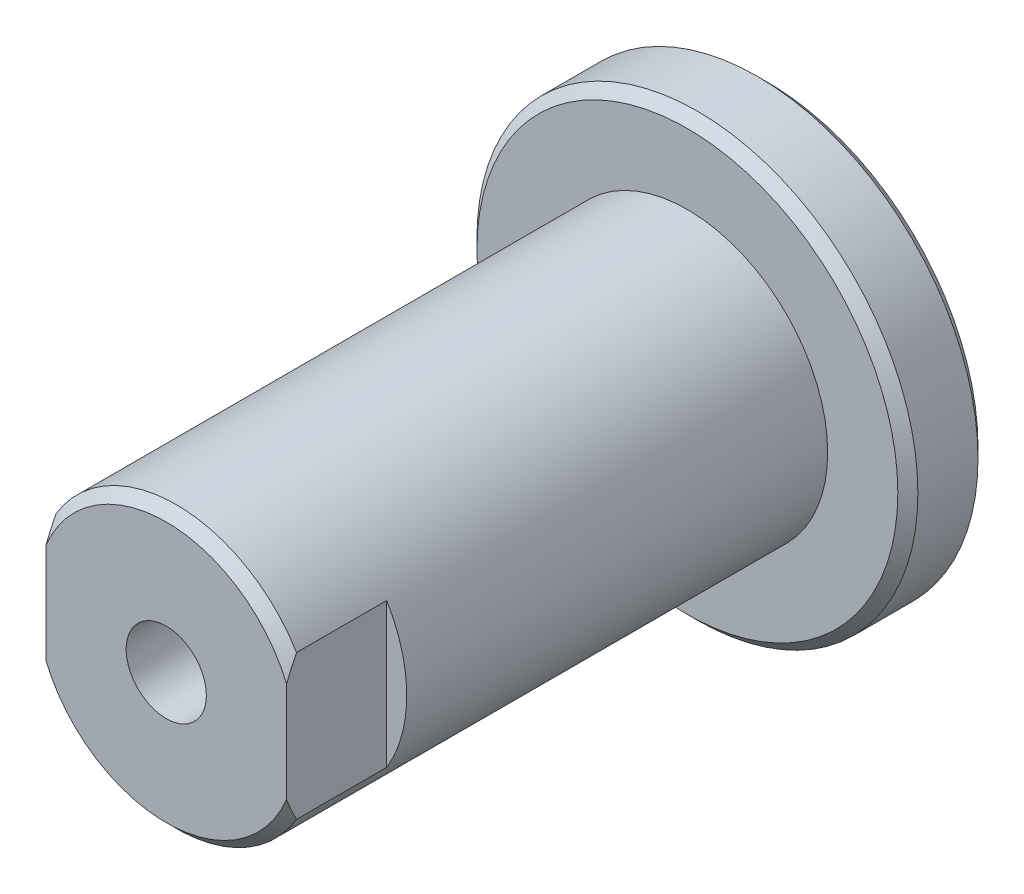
ISO-10303-21;
HEADER;
FILE_DESCRIPTION(('STEP AP214'),'2;1');
FILE_NAME('part.step','',(''),(''),'','','');
FILE_SCHEMA(('AUTOMOTIVE_DESIGN { 1 0 10303 214 1 1 1 1 }'));
ENDSEC;
DATA;
#1=APPLICATION_CONTEXT('core data for automotive mechanical design processes');
#2=APPLICATION_PROTOCOL_DEFINITION('international standard','automotive_design',2000,#1);
#3=PRODUCT_CONTEXT('',#1,'mechanical');
#4=PRODUCT('Part','Part','',(#3));
#5=PRODUCT_RELATED_PRODUCT_CATEGORY('part','',(#4));
#6=PRODUCT_DEFINITION_FORMATION('','',#4);
#7=PRODUCT_DEFINITION_CONTEXT('part definition',#1,'design');
#8=PRODUCT_DEFINITION('design','',#6,#7);
#9=PRODUCT_DEFINITION_SHAPE('','',#8);
#10=(LENGTH_UNIT() NAMED_UNIT(*) SI_UNIT(.MILLI.,.METRE.));
#11=(NAMED_UNIT(*) PLANE_ANGLE_UNIT() SI_UNIT($,.RADIAN.));
#12=(NAMED_UNIT(*) SI_UNIT($,.STERADIAN.) SOLID_ANGLE_UNIT());
#13=UNCERTAINTY_MEASURE_WITH_UNIT(LENGTH_MEASURE(1.E-05),#10,'distance_accuracy_value','');
#14=(GEOMETRIC_REPRESENTATION_CONTEXT(3) GLOBAL_UNCERTAINTY_ASSIGNED_CONTEXT((#13)) GLOBAL_UNIT_ASSIGNED_CONTEXT((#10,
#11,#12)) REPRESENTATION_CONTEXT('',''));
#15=CARTESIAN_POINT('',(0.,0.,0.));
#16=DIRECTION('',(0.,0.,1.));
#17=DIRECTION('',(1.,0.,0.));
#18=AXIS2_PLACEMENT_3D('',#15,#16,#17);
#19=CARTESIAN_POINT('',(0.,0.,30.));
#20=DIRECTION('',(0.,0.,-1.));
#21=DIRECTION('',(-1.,0.,0.));
#22=AXIS2_PLACEMENT_3D('',#19,#20,#21);
#23=CONICAL_SURFACE('',#22,6.5,0.785398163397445);
#24=CARTESIAN_POINT('',(-6.,-14.189120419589,21.0944445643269));
#25=CARTESIAN_POINT('',(-6.,-13.9783762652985,21.2885446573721));
#26=CARTESIAN_POINT('',(-6.,-13.7673091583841,21.4822940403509));
#27=CARTESIAN_POINT('',(-6.,-13.3444339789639,21.8689856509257));
#28=CARTESIAN_POINT('',(-6.,-13.1326259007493,22.0619278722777));
#29=CARTESIAN_POINT('',(-6.,-12.4958585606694,22.6394659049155));
#30=CARTESIAN_POINT('',(-6.,-12.0696493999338,23.0226870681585));
#31=CARTESIAN_POINT('',(-6.,-11.2102831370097,23.7865653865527));
#32=CARTESIAN_POINT('',(-6.,-10.7770995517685,24.1671928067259));
#33=CARTESIAN_POINT('',(-6.,-9.90489563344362,24.9216189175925));
#34=CARTESIAN_POINT('',(-6.,-9.46587600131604,25.2954184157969));
#35=CARTESIAN_POINT('',(-6.,-8.66228186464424,25.9645716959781));
#36=CARTESIAN_POINT('',(-6.,-8.29907851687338,26.2615642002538));
#37=CARTESIAN_POINT('',(-6.,-7.74886070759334,26.700373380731));
#38=CARTESIAN_POINT('',(-6.,-7.56452615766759,26.845549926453));
#39=CARTESIAN_POINT('',(-6.,-7.19377345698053,27.133214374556));
#40=CARTESIAN_POINT('',(-6.,-7.00735535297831,27.2757023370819));
#41=CARTESIAN_POINT('',(-6.,-6.63228473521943,27.5573006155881));
#42=CARTESIAN_POINT('',(-6.,-6.44363475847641,27.6964143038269));
#43=CARTESIAN_POINT('',(-6.,-6.0635049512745,27.9707110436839));
#44=CARTESIAN_POINT('',(-6.,-5.87202526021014,28.1058942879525));
#45=CARTESIAN_POINT('',(-6.,-5.48581052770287,28.3713809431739));
#46=CARTESIAN_POINT('',(-6.,-5.29107678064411,28.5016862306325));
#47=CARTESIAN_POINT('',(-6.,-4.89772697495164,28.756276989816));
#48=CARTESIAN_POINT('',(-6.,-4.69911136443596,28.8805631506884));
#49=CARTESIAN_POINT('',(-6.,-4.29915222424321,29.1204786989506));
#50=CARTESIAN_POINT('',(-6.,-4.09785008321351,29.2361766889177));
#51=CARTESIAN_POINT('',(-6.,-3.69005957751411,29.4581762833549));
#52=CARTESIAN_POINT('',(-6.,-3.48357065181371,29.5644768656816));
#53=CARTESIAN_POINT('',(-6.,-3.06498745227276,29.7649849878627));
#54=CARTESIAN_POINT('',(-6.,-2.8528986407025,29.859203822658));
#55=CARTESIAN_POINT('',(-6.,-2.42254844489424,30.0323888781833));
#56=CARTESIAN_POINT('',(-6.,-2.20428887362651,30.1113595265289));
#57=CARTESIAN_POINT('',(-6.,-1.80920727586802,30.2353361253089));
#58=CARTESIAN_POINT('',(-6.,-1.63353777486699,30.2839940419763));
#59=CARTESIAN_POINT('',(-6.,-1.27894637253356,30.3676229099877));
#60=CARTESIAN_POINT('',(-6.,-1.10002490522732,30.4025956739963));
#61=CARTESIAN_POINT('',(-6.,-0.740353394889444,30.4570998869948));
#62=CARTESIAN_POINT('',(-6.,-0.559610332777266,30.4766767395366));
#63=CARTESIAN_POINT('',(-6.,-0.197085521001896,30.4994890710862));
#64=CARTESIAN_POINT('',(-6.,-0.0153038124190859,30.5027251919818));
#65=CARTESIAN_POINT('',(-6.,0.348026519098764,30.4926630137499));
#66=CARTESIAN_POINT('',(-6.,0.529574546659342,30.4793435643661));
#67=CARTESIAN_POINT('',(-6.,0.890796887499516,30.4368881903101));
#68=CARTESIAN_POINT('',(-6.,1.07047104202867,30.4077509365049));
#69=CARTESIAN_POINT('',(-6.,1.42740071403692,30.3350322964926));
#70=CARTESIAN_POINT('',(-6.,1.60464720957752,30.2914072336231));
#71=CARTESIAN_POINT('',(-6.,1.9555280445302,30.1916103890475));
#72=CARTESIAN_POINT('',(-6.,2.12916232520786,30.1354384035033));
#73=CARTESIAN_POINT('',(-6.,2.50243151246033,30.0017905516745));
#74=CARTESIAN_POINT('',(-6.,2.70134325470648,29.9223089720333));
#75=CARTESIAN_POINT('',(-6.,3.09406710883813,29.7515219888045));
#76=CARTESIAN_POINT('',(-6.,3.28787684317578,29.6602111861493));
#77=CARTESIAN_POINT('',(-6.,3.67106823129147,29.467985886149));
#78=CARTESIAN_POINT('',(-6.,3.86044140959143,29.3670546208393));
#79=CARTESIAN_POINT('',(-6.,4.23490054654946,29.157636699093));
#80=CARTESIAN_POINT('',(-6.,4.41998710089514,29.0491511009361));
#81=CARTESIAN_POINT('',(-6.,4.78863644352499,28.8247540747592));
#82=CARTESIAN_POINT('',(-6.,4.97215428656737,28.7087691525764));
#83=CARTESIAN_POINT('',(-6.,5.33589527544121,28.4717527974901));
#84=CARTESIAN_POINT('',(-6.,5.51611833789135,28.3507212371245));
#85=CARTESIAN_POINT('',(-6.,5.87353199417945,28.1046683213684));
#86=CARTESIAN_POINT('',(-6.,6.05072558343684,27.9796513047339));
#87=CARTESIAN_POINT('',(-6.,6.4026678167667,27.7262165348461));
#88=CARTESIAN_POINT('',(-6.,6.57741636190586,27.5977986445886));
#89=CARTESIAN_POINT('',(-6.,7.0861535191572,27.2175520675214));
#90=CARTESIAN_POINT('',(-6.,7.41727857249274,26.9618924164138));
#91=CARTESIAN_POINT('',(-6.,8.0735777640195,26.4430411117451));
#92=CARTESIAN_POINT('',(-6.,8.39875139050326,26.1798488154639));
#93=CARTESIAN_POINT('',(-6.,9.04470289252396,25.6476667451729));
#94=CARTESIAN_POINT('',(-6.,9.3654774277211,25.3786729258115));
#95=CARTESIAN_POINT('',(-6.,10.0033851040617,24.836401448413));
#96=CARTESIAN_POINT('',(-6.,10.3205181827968,24.5631237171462));
#97=CARTESIAN_POINT('',(-6.,10.9366376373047,24.0264970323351));
#98=CARTESIAN_POINT('',(-6.,11.2357612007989,23.7633053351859));
#99=CARTESIAN_POINT('',(-6.,11.8318528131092,23.2344867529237));
#100=CARTESIAN_POINT('',(-6.,12.1288208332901,22.9688598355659));
#101=CARTESIAN_POINT('',(-6.,12.7205312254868,22.4360265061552));
#102=CARTESIAN_POINT('',(-6.,13.0152762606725,22.1688230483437));
#103=CARTESIAN_POINT('',(-6.,13.6032575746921,21.6327807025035));
#104=CARTESIAN_POINT('',(-6.,13.8964939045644,21.3639418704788));
#105=CARTESIAN_POINT('',(-6.,14.189120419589,21.0944445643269));
#106=B_SPLINE_CURVE_WITH_KNOTS('',3,(#24,#25,#26,#27,#28,#29,#30,#31,#32,#33,#34,#35,#36,#37,
#38,#39,#40,#41,#42,#43,#44,#45,#46,#47,#48,#49,#50,#51,#52,#53,#54,#55,#56,#57,#58,#59,#60,#61,
#62,#63,#64,#65,#66,#67,#68,#69,#70,#71,#72,#73,#74,#75,#76,#77,#78,#79,#80,#81,#82,#83,#84,#85,
#86,#87,#88,#89,#90,#91,#92,#93,#94,#95,#96,#97,#98,#99,#100,#101,#102,#103,#104,#105),
.UNSPECIFIED.,.F.,.F.,(4,2,2,2,2,2,2,2,2,2,2,2,2,2,2,2,2,2,2,2,2,2,2,2,2,2,2,2,2,2,2,2,2,2,2,2,
2,2,2,2,4),(0.,0.8595290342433,1.71906470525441,3.43851653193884,5.16841774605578,
6.89811302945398,8.30550929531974,9.00940677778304,9.71328849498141,10.4164350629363,
11.1195471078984,11.8223858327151,12.5251438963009,13.2214938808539,13.9179195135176,
14.6136892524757,15.3092566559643,15.8556421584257,16.4019552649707,16.9466511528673,
17.4913256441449,18.0366966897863,18.5821135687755,19.129189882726,19.6762750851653,
20.3183990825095,20.960817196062,21.6043762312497,22.2478452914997,22.8990367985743,
23.5502447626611,24.2007664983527,24.8513144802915,26.106152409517,27.3610977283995,
28.6169483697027,29.872820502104,31.0680882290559,32.2633718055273,33.4568688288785,
34.6503252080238),.UNSPECIFIED.);
#107=CARTESIAN_POINT('',(-6.,-3.60555127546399,29.5));
#108=VERTEX_POINT('',#107);
#109=CARTESIAN_POINT('',(-6.,-2.5,30.));
#110=VERTEX_POINT('',#109);
#111=EDGE_CURVE('E39',#108,#110,#106,.T.);
#112=ORIENTED_EDGE('',*,*,#111,.F.);
#113=CARTESIAN_POINT('',(0.,0.,29.5));
#114=DIRECTION('',(0.,0.,1.));
#115=DIRECTION('',(1.,0.,0.));
#116=AXIS2_PLACEMENT_3D('',#113,#114,#115);
#117=CIRCLE('',#116,7.);
#118=CARTESIAN_POINT('',(6.,-3.60555127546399,29.5));
#119=VERTEX_POINT('',#118);
#120=EDGE_CURVE('E108',#119,#108,#117,.F.);
#121=ORIENTED_EDGE('',*,*,#120,.F.);
#122=CARTESIAN_POINT('',(6.,14.189120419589,21.0944445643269));
#123=CARTESIAN_POINT('',(6.,13.9783762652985,21.2885446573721));
#124=CARTESIAN_POINT('',(6.,13.7673091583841,21.4822940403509));
#125=CARTESIAN_POINT('',(6.,13.3444339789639,21.8689856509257));
#126=CARTESIAN_POINT('',(6.,13.1326259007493,22.0619278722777));
#127=CARTESIAN_POINT('',(6.,12.4958585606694,22.6394659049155));
#128=CARTESIAN_POINT('',(6.,12.0696493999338,23.0226870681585));
#129=CARTESIAN_POINT('',(6.,11.2102831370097,23.7865653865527));
#130=CARTESIAN_POINT('',(6.,10.7770995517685,24.1671928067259));
#131=CARTESIAN_POINT('',(6.,9.90489563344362,24.9216189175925));
#132=CARTESIAN_POINT('',(6.,9.46587600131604,25.2954184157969));
#133=CARTESIAN_POINT('',(6.,8.66228186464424,25.9645716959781));
#134=CARTESIAN_POINT('',(6.,8.29907851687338,26.2615642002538));
#135=CARTESIAN_POINT('',(6.,7.74886070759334,26.700373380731));
#136=CARTESIAN_POINT('',(6.,7.56452615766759,26.845549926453));
#137=CARTESIAN_POINT('',(6.,7.19377345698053,27.133214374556));
#138=CARTESIAN_POINT('',(6.,7.00735535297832,27.2757023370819));
#139=CARTESIAN_POINT('',(6.,6.63228473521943,27.5573006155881));
#140=CARTESIAN_POINT('',(6.,6.44363475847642,27.6964143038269));
#141=CARTESIAN_POINT('',(6.,6.06350495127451,27.9707110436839));
#142=CARTESIAN_POINT('',(6.,5.87202526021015,28.1058942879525));
#143=CARTESIAN_POINT('',(6.,5.48581052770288,28.3713809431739));
#144=CARTESIAN_POINT('',(6.,5.29107678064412,28.5016862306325));
#145=CARTESIAN_POINT('',(6.,4.89772697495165,28.756276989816));
#146=CARTESIAN_POINT('',(6.,4.69911136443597,28.8805631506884));
#147=CARTESIAN_POINT('',(6.,4.29915222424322,29.1204786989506));
#148=CARTESIAN_POINT('',(6.,4.09785008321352,29.2361766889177));
#149=CARTESIAN_POINT('',(6.,3.69005957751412,29.4581762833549));
#150=CARTESIAN_POINT('',(6.,3.48357065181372,29.5644768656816));
#151=CARTESIAN_POINT('',(6.,3.06498745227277,29.7649849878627));
#152=CARTESIAN_POINT('',(6.,2.85289864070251,29.859203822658));
#153=CARTESIAN_POINT('',(6.,2.42254844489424,30.0323888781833));
#154=CARTESIAN_POINT('',(6.,2.20428887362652,30.1113595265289));
#155=CARTESIAN_POINT('',(6.,1.80920727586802,30.2353361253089));
#156=CARTESIAN_POINT('',(6.,1.633537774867,30.2839940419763));
#157=CARTESIAN_POINT('',(6.,1.27894637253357,30.3676229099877));
#158=CARTESIAN_POINT('',(6.,1.10002490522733,30.4025956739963));
#159=CARTESIAN_POINT('',(6.,0.740353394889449,30.4570998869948));
#160=CARTESIAN_POINT('',(6.,0.559610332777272,30.4766767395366));
#161=CARTESIAN_POINT('',(6.,0.197085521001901,30.4994890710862));
#162=CARTESIAN_POINT('',(6.,0.0153038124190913,30.5027251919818));
#163=CARTESIAN_POINT('',(6.,-0.348026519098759,30.4926630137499));
#164=CARTESIAN_POINT('',(6.,-0.529574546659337,30.4793435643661));
#165=CARTESIAN_POINT('',(6.,-0.890796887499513,30.4368881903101));
#166=CARTESIAN_POINT('',(6.,-1.07047104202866,30.4077509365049));
#167=CARTESIAN_POINT('',(6.,-1.42740071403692,30.3350322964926));
#168=CARTESIAN_POINT('',(6.,-1.60464720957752,30.2914072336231));
#169=CARTESIAN_POINT('',(6.,-1.95552804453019,30.1916103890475));
#170=CARTESIAN_POINT('',(6.,-2.12916232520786,30.1354384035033));
#171=CARTESIAN_POINT('',(6.,-2.50243151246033,30.0017905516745));
#172=CARTESIAN_POINT('',(6.,-2.70134325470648,29.9223089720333));
#173=CARTESIAN_POINT('',(6.,-3.09406710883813,29.7515219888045));
#174=CARTESIAN_POINT('',(6.,-3.28787684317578,29.6602111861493));
#175=CARTESIAN_POINT('',(6.,-3.67106823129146,29.467985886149));
#176=CARTESIAN_POINT('',(6.,-3.86044140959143,29.3670546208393));
#177=CARTESIAN_POINT('',(6.,-4.23490054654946,29.157636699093));
#178=CARTESIAN_POINT('',(6.,-4.41998710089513,29.0491511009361));
#179=CARTESIAN_POINT('',(6.,-4.78863644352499,28.8247540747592));
#180=CARTESIAN_POINT('',(6.,-4.97215428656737,28.7087691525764));
#181=CARTESIAN_POINT('',(6.,-5.3358952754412,28.4717527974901));
#182=CARTESIAN_POINT('',(6.,-5.51611833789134,28.3507212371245));
#183=CARTESIAN_POINT('',(6.,-5.87353199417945,28.1046683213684));
#184=CARTESIAN_POINT('',(6.,-6.05072558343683,27.9796513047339));
#185=CARTESIAN_POINT('',(6.,-6.40266781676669,27.7262165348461));
#186=CARTESIAN_POINT('',(6.,-6.57741636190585,27.5977986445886));
#187=CARTESIAN_POINT('',(6.,-7.08615351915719,27.2175520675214));
#188=CARTESIAN_POINT('',(6.,-7.41727857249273,26.9618924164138));
#189=CARTESIAN_POINT('',(6.,-8.07357776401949,26.4430411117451));
#190=CARTESIAN_POINT('',(6.,-8.39875139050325,26.1798488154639));
#191=CARTESIAN_POINT('',(6.,-9.04470289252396,25.6476667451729));
#192=CARTESIAN_POINT('',(6.,-9.36547742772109,25.3786729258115));
#193=CARTESIAN_POINT('',(6.,-10.0033851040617,24.836401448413));
#194=CARTESIAN_POINT('',(6.,-10.3205181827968,24.5631237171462));
#195=CARTESIAN_POINT('',(6.,-10.9366376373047,24.0264970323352));
#196=CARTESIAN_POINT('',(6.,-11.2357612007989,23.7633053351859));
#197=CARTESIAN_POINT('',(6.,-11.8318528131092,23.2344867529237));
#198=CARTESIAN_POINT('',(6.,-12.1288208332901,22.9688598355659));
#199=CARTESIAN_POINT('',(6.,-12.7205312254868,22.4360265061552));
#200=CARTESIAN_POINT('',(6.,-13.0152762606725,22.1688230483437));
#201=CARTESIAN_POINT('',(6.,-13.6032575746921,21.6327807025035));
#202=CARTESIAN_POINT('',(6.,-13.8964939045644,21.3639418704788));
#203=CARTESIAN_POINT('',(6.,-14.189120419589,21.0944445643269));
#204=B_SPLINE_CURVE_WITH_KNOTS('',3,(#122,#123,#124,#125,#126,#127,#128,#129,#130,#131,#132,
#133,#134,#135,#136,#137,#138,#139,#140,#141,#142,#143,#144,#145,#146,#147,#148,#149,#150,#151,
#152,#153,#154,#155,#156,#157,#158,#159,#160,#161,#162,#163,#164,#165,#166,#167,#168,#169,#170,
#171,#172,#173,#174,#175,#176,#177,#178,#179,#180,#181,#182,#183,#184,#185,#186,#187,#188,#189,
#190,#191,#192,#193,#194,#195,#196,#197,#198,#199,#200,#201,#202,#203),.UNSPECIFIED.,.F.,.F.,(4,
2,2,2,2,2,2,2,2,2,2,2,2,2,2,2,2,2,2,2,2,2,2,2,2,2,2,2,2,2,2,2,2,2,2,2,2,2,2,2,4),(0.,
0.859529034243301,1.71906470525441,3.43851653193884,5.16841774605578,6.89811302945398,
8.30550929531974,9.00940677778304,9.7132884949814,10.4164350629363,11.1195471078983,
11.822385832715,12.5251438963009,13.2214938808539,13.9179195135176,14.6136892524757,
15.3092566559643,15.8556421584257,16.4019552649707,16.9466511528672,17.4913256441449,
18.0366966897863,18.5821135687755,19.129189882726,19.6762750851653,20.3183990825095,
20.960817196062,21.6043762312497,22.2478452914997,22.8990367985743,23.5502447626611,
24.2007664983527,24.8513144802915,26.106152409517,27.3610977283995,28.6169483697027,
29.872820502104,31.0680882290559,32.2633718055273,33.4568688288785,34.6503252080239),.UNSPECIFIED.);
#205=CARTESIAN_POINT('',(6.,-2.5,30.));
#206=VERTEX_POINT('',#205);
#207=EDGE_CURVE('E99',#206,#119,#204,.T.);
#208=ORIENTED_EDGE('',*,*,#207,.F.);
#209=CARTESIAN_POINT('',(0.,0.,30.));
#210=DIRECTION('',(0.,0.,1.));
#211=DIRECTION('',(1.,0.,0.));
#212=AXIS2_PLACEMENT_3D('',#209,#210,#211);
#213=CIRCLE('',#212,6.5);
#214=EDGE_CURVE('E53',#110,#206,#213,.T.);
#215=ORIENTED_EDGE('',*,*,#214,.F.);
#216=EDGE_LOOP('',(#112,#121,#208,#215));
#217=FACE_BOUND('',#216,.T.);
#218=ADVANCED_FACE('F31',(#217),#23,.T.);
#219=CARTESIAN_POINT('',(0.,0.,4.));
#220=DIRECTION('',(0.,0.,1.));
#221=DIRECTION('',(1.,0.,0.));
#222=AXIS2_PLACEMENT_3D('',#219,#220,#221);
#223=PLANE('',#222);
#224=CARTESIAN_POINT('',(0.,0.,4.));
#225=DIRECTION('',(0.,0.,1.));
#226=DIRECTION('',(1.,0.,0.));
#227=AXIS2_PLACEMENT_3D('',#224,#225,#226);
#228=CIRCLE('',#227,10.5);
#229=CARTESIAN_POINT('',(10.5,0.,4.));
#230=VERTEX_POINT('',#229);
#231=EDGE_CURVE('E100',#230,#230,#228,.T.);
#232=ORIENTED_EDGE('',*,*,#231,.T.);
#233=EDGE_LOOP('',(#232));
#234=FACE_BOUND('',#233,.T.);
#235=CARTESIAN_POINT('',(0.,0.,4.));
#236=DIRECTION('',(0.,0.,1.));
#237=DIRECTION('',(1.,0.,0.));
#238=AXIS2_PLACEMENT_3D('',#235,#236,#237);
#239=CIRCLE('',#238,7.);
#240=CARTESIAN_POINT('',(7.,0.,4.));
#241=VERTEX_POINT('',#240);
#242=EDGE_CURVE('E166',#241,#241,#239,.T.);
#243=ORIENTED_EDGE('',*,*,#242,.F.);
#244=EDGE_LOOP('',(#243));
#245=FACE_BOUND('',#244,.T.);
#246=ADVANCED_FACE('F188',(#234,#245),#223,.T.);
#247=CARTESIAN_POINT('',(0.,0.,4.));
#248=DIRECTION('',(0.,0.,-1.));
#249=DIRECTION('',(-1.,0.,0.));
#250=AXIS2_PLACEMENT_3D('',#247,#248,#249);
#251=CYLINDRICAL_SURFACE('',#250,11.);
#252=CARTESIAN_POINT('',(0.,0.,0.5));
#253=DIRECTION('',(0.,0.,1.));
#254=DIRECTION('',(1.,0.,0.));
#255=AXIS2_PLACEMENT_3D('',#252,#253,#254);
#256=CIRCLE('',#255,11.);
#257=CARTESIAN_POINT('',(11.,0.,0.5));
#258=VERTEX_POINT('',#257);
#259=EDGE_CURVE('E172',#258,#258,#256,.T.);
#260=ORIENTED_EDGE('',*,*,#259,.T.);
#261=EDGE_LOOP('',(#260));
#262=FACE_BOUND('',#261,.T.);
#263=CARTESIAN_POINT('',(0.,0.,3.5));
#264=DIRECTION('',(0.,0.,1.));
#265=DIRECTION('',(1.,0.,0.));
#266=AXIS2_PLACEMENT_3D('',#263,#264,#265);
#267=CIRCLE('',#266,11.);
#268=CARTESIAN_POINT('',(11.,0.,3.5));
#269=VERTEX_POINT('',#268);
#270=EDGE_CURVE('E169',#269,#269,#267,.F.);
#271=ORIENTED_EDGE('',*,*,#270,.T.);
#272=EDGE_LOOP('',(#271));
#273=FACE_BOUND('',#272,.T.);
#274=ADVANCED_FACE('F33',(#262,#273),#251,.T.);
#275=CARTESIAN_POINT('',(0.,0.,0.));
#276=DIRECTION('',(0.,0.,1.));
#277=DIRECTION('',(1.,0.,0.));
#278=AXIS2_PLACEMENT_3D('',#275,#276,#277);
#279=PLANE('',#278);
#280=CARTESIAN_POINT('',(0.,0.,0.));
#281=DIRECTION('',(0.,0.,1.));
#282=DIRECTION('',(1.,0.,0.));
#283=AXIS2_PLACEMENT_3D('',#280,#281,#282);
#284=CIRCLE('',#283,2.);
#285=CARTESIAN_POINT('',(2.,0.,0.));
#286=VERTEX_POINT('',#285);
#287=EDGE_CURVE('E299',#286,#286,#284,.T.);
#288=ORIENTED_EDGE('',*,*,#287,.T.);
#289=EDGE_LOOP('',(#288));
#290=FACE_BOUND('',#289,.T.);
#291=CARTESIAN_POINT('',(0.,0.,0.));
#292=DIRECTION('',(0.,0.,1.));
#293=DIRECTION('',(1.,0.,0.));
#294=AXIS2_PLACEMENT_3D('',#291,#292,#293);
#295=CIRCLE('',#294,10.5);
#296=CARTESIAN_POINT('',(10.5,0.,0.));
#297=VERTEX_POINT('',#296);
#298=EDGE_CURVE('E104',#297,#297,#295,.F.);
#299=ORIENTED_EDGE('',*,*,#298,.T.);
#300=EDGE_LOOP('',(#299));
#301=FACE_BOUND('',#300,.T.);
#302=ADVANCED_FACE('F177',(#290,#301),#279,.F.);
#303=CARTESIAN_POINT('',(0.,0.,30.));
#304=DIRECTION('',(0.,0.,-1.));
#305=DIRECTION('',(-1.,0.,0.));
#306=AXIS2_PLACEMENT_3D('',#303,#304,#305);
#307=CYLINDRICAL_SURFACE('',#306,7.);
#308=ORIENTED_EDGE('',*,*,#120,.T.);
#309=DIRECTION('',(0.,0.,-1.));
#310=VECTOR('',#309,1.);
#311=CARTESIAN_POINT('',(-6.,-3.60555127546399,30.));
#312=LINE('',#311,#310);
#313=CARTESIAN_POINT('',(-6.,-3.60555127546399,25.));
#314=VERTEX_POINT('',#313);
#315=EDGE_CURVE('E86',#108,#314,#312,.T.);
#316=ORIENTED_EDGE('',*,*,#315,.T.);
#317=CARTESIAN_POINT('',(0.,0.,25.));
#318=DIRECTION('',(0.,0.,-1.));
#319=DIRECTION('',(-1.,0.,0.));
#320=AXIS2_PLACEMENT_3D('',#317,#318,#319);
#321=CIRCLE('',#320,7.);
#322=CARTESIAN_POINT('',(-6.,3.60555127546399,25.));
#323=VERTEX_POINT('',#322);
#324=EDGE_CURVE('E11',#314,#323,#321,.T.);
#325=ORIENTED_EDGE('',*,*,#324,.T.);
#326=DIRECTION('',(0.,0.,-1.));
#327=VECTOR('',#326,1.);
#328=CARTESIAN_POINT('',(-6.,3.60555127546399,30.));
#329=LINE('',#328,#327);
#330=CARTESIAN_POINT('',(-6.,3.60555127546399,29.5));
#331=VERTEX_POINT('',#330);
#332=EDGE_CURVE('E155',#323,#331,#329,.F.);
#333=ORIENTED_EDGE('',*,*,#332,.T.);
#334=CARTESIAN_POINT('',(6.,3.60555127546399,29.5));
#335=VERTEX_POINT('',#334);
#336=EDGE_CURVE('E102',#331,#335,#117,.F.);
#337=ORIENTED_EDGE('',*,*,#336,.T.);
#338=DIRECTION('',(0.,0.,-1.));
#339=VECTOR('',#338,1.);
#340=CARTESIAN_POINT('',(6.,3.60555127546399,30.));
#341=LINE('',#340,#339);
#342=CARTESIAN_POINT('',(6.,3.60555127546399,25.));
#343=VERTEX_POINT('',#342);
#344=EDGE_CURVE('E147',#335,#343,#341,.T.);
#345=ORIENTED_EDGE('',*,*,#344,.T.);
#346=CARTESIAN_POINT('',(0.,0.,25.));
#347=DIRECTION('',(0.,0.,1.));
#348=DIRECTION('',(1.,0.,0.));
#349=AXIS2_PLACEMENT_3D('',#346,#347,#348);
#350=CIRCLE('',#349,7.);
#351=CARTESIAN_POINT('',(6.,-3.60555127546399,25.));
#352=VERTEX_POINT('',#351);
#353=EDGE_CURVE('E117',#352,#343,#350,.T.);
#354=ORIENTED_EDGE('',*,*,#353,.F.);
#355=DIRECTION('',(0.,0.,-1.));
#356=VECTOR('',#355,1.);
#357=CARTESIAN_POINT('',(6.,-3.60555127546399,30.));
#358=LINE('',#357,#356);
#359=EDGE_CURVE('E162',#352,#119,#358,.F.);
#360=ORIENTED_EDGE('',*,*,#359,.T.);
#361=EDGE_LOOP('',(#308,#316,#325,#333,#337,#345,#354,#360));
#362=FACE_BOUND('',#361,.T.);
#363=ORIENTED_EDGE('',*,*,#242,.T.);
#364=EDGE_LOOP('',(#363));
#365=FACE_BOUND('',#364,.T.);
#366=ADVANCED_FACE('F153',(#362,#365),#307,.T.);
#367=CARTESIAN_POINT('',(0.,0.,30.));
#368=DIRECTION('',(0.,0.,1.));
#369=DIRECTION('',(1.,0.,0.));
#370=AXIS2_PLACEMENT_3D('',#367,#368,#369);
#371=PLANE('',#370);
#372=CARTESIAN_POINT('',(0.,0.,30.));
#373=DIRECTION('',(0.,0.,1.));
#374=DIRECTION('',(1.,0.,0.));
#375=AXIS2_PLACEMENT_3D('',#372,#373,#374);
#376=CIRCLE('',#375,1.99999999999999);
#377=CARTESIAN_POINT('',(1.99999999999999,0.,30.));
#378=VERTEX_POINT('',#377);
#379=EDGE_CURVE('E96',#378,#378,#376,.T.);
#380=ORIENTED_EDGE('',*,*,#379,.F.);
#381=EDGE_LOOP('',(#380));
#382=FACE_BOUND('',#381,.T.);
#383=DIRECTION('',(0.,1.,0.));
#384=VECTOR('',#383,1.);
#385=CARTESIAN_POINT('',(-6.,13.8098106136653,30.));
#386=LINE('',#385,#384);
#387=CARTESIAN_POINT('',(-6.,2.5,30.));
#388=VERTEX_POINT('',#387);
#389=EDGE_CURVE('E46',#110,#388,#386,.T.);
#390=ORIENTED_EDGE('',*,*,#389,.F.);
#391=ORIENTED_EDGE('',*,*,#214,.T.);
#392=DIRECTION('',(0.,-1.,0.));
#393=VECTOR('',#392,1.);
#394=CARTESIAN_POINT('',(6.,11.2333534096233,30.));
#395=LINE('',#394,#393);
#396=CARTESIAN_POINT('',(6.,2.5,30.));
#397=VERTEX_POINT('',#396);
#398=EDGE_CURVE('E145',#397,#206,#395,.T.);
#399=ORIENTED_EDGE('',*,*,#398,.F.);
#400=EDGE_CURVE('E94',#397,#388,#213,.T.);
#401=ORIENTED_EDGE('',*,*,#400,.T.);
#402=EDGE_LOOP('',(#390,#391,#399,#401));
#403=FACE_BOUND('',#402,.T.);
#404=ADVANCED_FACE('F92',(#382,#403),#371,.T.);
#405=CARTESIAN_POINT('',(0.,0.,0.5));
#406=DIRECTION('',(0.,0.,1.));
#407=DIRECTION('',(1.,0.,0.));
#408=AXIS2_PLACEMENT_3D('',#405,#406,#407);
#409=CONICAL_SURFACE('',#408,11.,0.78539816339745);
#410=ORIENTED_EDGE('',*,*,#298,.F.);
#411=EDGE_LOOP('',(#410));
#412=FACE_BOUND('',#411,.T.);
#413=ORIENTED_EDGE('',*,*,#259,.F.);
#414=EDGE_LOOP('',(#413));
#415=FACE_BOUND('',#414,.T.);
#416=ADVANCED_FACE('F179',(#412,#415),#409,.T.);
#417=CARTESIAN_POINT('',(0.,0.,4.));
#418=DIRECTION('',(0.,0.,-1.));
#419=DIRECTION('',(-1.,0.,0.));
#420=AXIS2_PLACEMENT_3D('',#417,#418,#419);
#421=CONICAL_SURFACE('',#420,10.5,0.785398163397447);
#422=ORIENTED_EDGE('',*,*,#270,.F.);
#423=EDGE_LOOP('',(#422));
#424=FACE_BOUND('',#423,.T.);
#425=ORIENTED_EDGE('',*,*,#231,.F.);
#426=EDGE_LOOP('',(#425));
#427=FACE_BOUND('',#426,.T.);
#428=ADVANCED_FACE('F182',(#424,#427),#421,.T.);
#429=EDGE_CURVE('E90',#388,#331,#106,.T.);
#430=ORIENTED_EDGE('',*,*,#429,.F.);
#431=ORIENTED_EDGE('',*,*,#400,.F.);
#432=EDGE_CURVE('E116',#335,#397,#204,.T.);
#433=ORIENTED_EDGE('',*,*,#432,.F.);
#434=ORIENTED_EDGE('',*,*,#336,.F.);
#435=EDGE_LOOP('',(#430,#431,#433,#434));
#436=FACE_BOUND('',#435,.T.);
#437=ADVANCED_FACE('F118',(#436),#23,.T.);
#438=CARTESIAN_POINT('',(6.,-10.6150036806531,25.));
#439=DIRECTION('',(0.,0.,1.));
#440=DIRECTION('',(1.,0.,0.));
#441=AXIS2_PLACEMENT_3D('',#438,#439,#440);
#442=PLANE('',#441);
#443=ORIENTED_EDGE('',*,*,#353,.T.);
#444=DIRECTION('',(0.,-1.,0.));
#445=VECTOR('',#444,1.);
#446=CARTESIAN_POINT('',(6.,11.2333534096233,25.));
#447=LINE('',#446,#445);
#448=EDGE_CURVE('E150',#343,#352,#447,.T.);
#449=ORIENTED_EDGE('',*,*,#448,.T.);
#450=EDGE_LOOP('',(#443,#449));
#451=FACE_BOUND('',#450,.T.);
#452=ADVANCED_FACE('F126',(#451),#442,.T.);
#453=CARTESIAN_POINT('',(6.,11.2333534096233,25.));
#454=DIRECTION('',(-1.,0.,0.));
#455=DIRECTION('',(0.,-1.,0.));
#456=AXIS2_PLACEMENT_3D('',#453,#454,#455);
#457=PLANE('',#456);
#458=ORIENTED_EDGE('',*,*,#432,.T.);
#459=ORIENTED_EDGE('',*,*,#398,.T.);
#460=ORIENTED_EDGE('',*,*,#207,.T.);
#461=ORIENTED_EDGE('',*,*,#359,.F.);
#462=ORIENTED_EDGE('',*,*,#448,.F.);
#463=ORIENTED_EDGE('',*,*,#344,.F.);
#464=EDGE_LOOP('',(#458,#459,#460,#461,#462,#463));
#465=FACE_BOUND('',#464,.T.);
#466=ADVANCED_FACE('F121',(#465),#457,.F.);
#467=CARTESIAN_POINT('',(-6.,-10.6150036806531,25.));
#468=DIRECTION('',(0.,0.,-1.));
#469=DIRECTION('',(-1.,0.,0.));
#470=AXIS2_PLACEMENT_3D('',#467,#468,#469);
#471=PLANE('',#470);
#472=DIRECTION('',(0.,1.,0.));
#473=VECTOR('',#472,1.);
#474=CARTESIAN_POINT('',(-6.,13.8098106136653,25.));
#475=LINE('',#474,#473);
#476=EDGE_CURVE('E95',#314,#323,#475,.T.);
#477=ORIENTED_EDGE('',*,*,#476,.T.);
#478=ORIENTED_EDGE('',*,*,#324,.F.);
#479=EDGE_LOOP('',(#477,#478));
#480=FACE_BOUND('',#479,.T.);
#481=ADVANCED_FACE('F125',(#480),#471,.F.);
#482=CARTESIAN_POINT('',(-6.,13.8098106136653,25.));
#483=DIRECTION('',(1.,0.,0.));
#484=DIRECTION('',(0.,1.,0.));
#485=AXIS2_PLACEMENT_3D('',#482,#483,#484);
#486=PLANE('',#485);
#487=ORIENTED_EDGE('',*,*,#111,.T.);
#488=ORIENTED_EDGE('',*,*,#389,.T.);
#489=ORIENTED_EDGE('',*,*,#429,.T.);
#490=ORIENTED_EDGE('',*,*,#332,.F.);
#491=ORIENTED_EDGE('',*,*,#476,.F.);
#492=ORIENTED_EDGE('',*,*,#315,.F.);
#493=EDGE_LOOP('',(#487,#488,#489,#490,#491,#492));
#494=FACE_BOUND('',#493,.T.);
#495=ADVANCED_FACE('F83',(#494),#486,.F.);
#496=CARTESIAN_POINT('',(0.,0.,30.));
#497=DIRECTION('',(0.,0.,1.));
#498=DIRECTION('',(1.,0.,0.));
#499=AXIS2_PLACEMENT_3D('',#496,#497,#498);
#500=CYLINDRICAL_SURFACE('',#499,1.99999999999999);
#501=ORIENTED_EDGE('',*,*,#287,.F.);
#502=EDGE_LOOP('',(#501));
#503=FACE_BOUND('',#502,.T.);
#504=ORIENTED_EDGE('',*,*,#379,.T.);
#505=EDGE_LOOP('',(#504));
#506=FACE_BOUND('',#505,.T.);
#507=ADVANCED_FACE('F134',(#503,#506),#500,.F.);
#508=CLOSED_SHELL('',(#218,#246,#274,#302,#366,#404,#416,#428,#437,#452,#466,#481,#495,#507));
#509=MANIFOLD_SOLID_BREP('B2',#508);
#510=ADVANCED_BREP_SHAPE_REPRESENTATION('',(#18,#509),#14);
#511=SHAPE_DEFINITION_REPRESENTATION(#9,#510);
ENDSEC;
END-ISO-10303-21;
